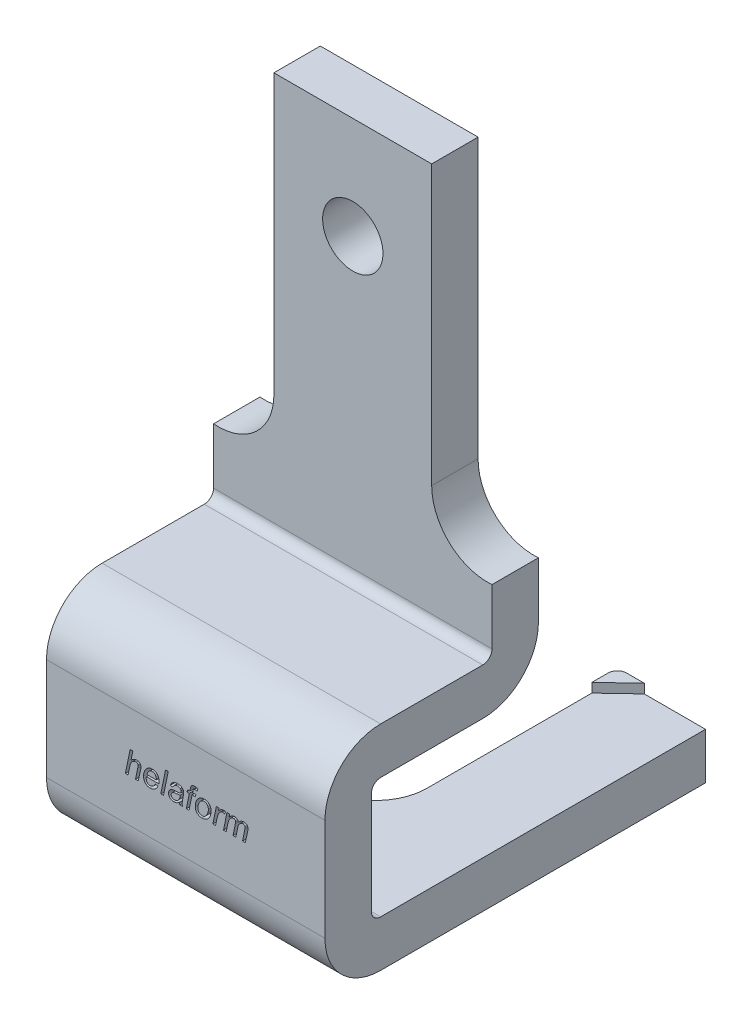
from build123d import *

# Parameters (mm, degrees)
EXTRUDE1_DEPTH     = 30
EXTRUDE4_REACH     = 78.059
FILLET2_R          = 1
EXTRUDE5_START     = 1
EXTRUDE5_DEPTH     = 1
EXTRUDE6_REACH     = 78.059
EXTRUDE7_REACH     = 78.059
SKETCH7_R          = 3.25
CUT_EXTRUDE1_DEPTH = 1


with BuildPart() as part:
    # Sketch1 → Extrude1 (new body)
    with BuildSketch(Plane(origin=(0, 0, 0), x_dir=(0, 0, -1), z_dir=(1, 0, 0))):
        with BuildLine():
            Line((0, 0), (0, -42))
            ThreePointArc((0, -42), (-0.292893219, -42.707106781), (-1, -43))
            Line((-1, -43), (-12, -43))
            ThreePointArc((-12, -43), (-16.242640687, -44.757359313), (-18, -49))
            Line((-18, -49), (-18, -60))
            ThreePointArc((-18, -60), (-16.242640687, -64.242640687), (-12, -66))
            Line((-12, -66), (23, -66))
            Line((23, -66), (23, -61))
            Line((23, -61), (-12, -61))
            ThreePointArc((-12, -61), (-12.707106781, -60.707106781), (-13, -60))
            Line((-13, -60), (-13, -49))
            ThreePointArc((-13, -49), (-12.707106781, -48.292893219), (-12, -48))
            Line((-12, -48), (-1, -48))
            ThreePointArc((-1, -48), (3.242640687, -46.242640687), (5, -42))
            Line((5, -42), (5, 0))
            Line((5, 0), (0, 0))
        make_face()
    extrude(amount=EXTRUDE1_DEPTH)

    # Sketch4 → Extrude4 (cut, up to next)
    with BuildSketch(Plane.XZ.offset(66), mode=Mode.PRIVATE) as extrude4_sk1:
        with BuildLine():
            Line((9.5, -23), (9.5, -2.5))
            ThreePointArc((9.5, -2.5), (15, 3), (20.5, -2.5))
            Line((20.5, -2.5), (20.5, -23))
            Line((20.5, -23), (9.5, -23))
        make_face()
    extrude4_tool1 = extrude(extrude4_sk1.sketch, amount=-EXTRUDE4_REACH, mode=Mode.PRIVATE) & part.part
    add(extrude4_tool1.solids().sort_by_distance((15, -66, -10.559797))[0], mode=Mode.SUBTRACT)

    # Fillet2
    fillet2_edges = [part.edges().sort_by_distance(p)[0] for p in [
        (20.5, -63.5, -23),
        (9.5, -63.5, -23),
    ]]
    fillet(fillet2_edges, radius=FILLET2_R)

    # Sketch5 → Extrude5 (add)
    with BuildSketch(Plane(origin=(0, -61, 0), x_dir=(1, 0, 0), z_dir=(0, 1, 0)).offset(EXTRUDE5_START)):
        with BuildLine():
            Line((23.404445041, 23), (20.5, 20.249691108))
            Line((20.5, 20.249691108), (20.5, 22))
            ThreePointArc((20.5, 22), (20.792893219, 22.707106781), (21.5, 23))
            Line((21.5, 23), (23.404445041, 23))
        make_face()
        with BuildLine():
            Line((6.595554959, 23), (8.5, 23))
            ThreePointArc((8.5, 23), (9.207106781, 22.707106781), (9.5, 22))
            Line((9.5, 22), (9.5, 20.249691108))
            Line((9.5, 20.249691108), (6.595554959, 23))
        make_face()
    extrude(amount=-EXTRUDE5_DEPTH)

    # Sketch6 → Extrude6 (cut, up to next)
    with BuildSketch(Plane(origin=(0, 0, -5), x_dir=(-1, 0, 0), z_dir=(0, 0, -1)), mode=Mode.PRIVATE) as extrude6_sk1:
        with BuildLine():
            Line((-6.5, 0), (-6.5, -30.020869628))
            ThreePointArc((-6.5, -30.020869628), (-4.562019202, -34.436750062), (0, -36))
            Line((0, -36), (0, 0))
            Line((0, 0), (-6.5, 0))
        make_face()
    extrude6_tool1 = extrude(extrude6_sk1.sketch, amount=-EXTRUDE6_REACH, mode=Mode.PRIVATE) & part.part
    # Sketch6 → Extrude6 (cut, up to next)
    with BuildSketch(Plane(origin=(0, 0, -5), x_dir=(-1, 0, 0), z_dir=(0, 0, -1)), mode=Mode.PRIVATE) as extrude6_sk2:
        with BuildLine():
            Line((-30, 0), (-23.5, 0))
            Line((-23.5, 0), (-23.5, -30.020869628))
            ThreePointArc((-23.5, -30.020869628), (-25.437980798, -34.436750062), (-30, -36))
            Line((-30, -36), (-30, 0))
        make_face()
    extrude6_tool2 = extrude(extrude6_sk2.sketch, amount=-EXTRUDE6_REACH, mode=Mode.PRIVATE) & part.part
    add(extrude6_tool1.solids().sort_by_distance((3.18488, -17.44132, -5))[0], mode=Mode.SUBTRACT)
    add(extrude6_tool2.solids().sort_by_distance((26.81512, -17.44132, -5))[0], mode=Mode.SUBTRACT)

    # Sketch7 → Extrude7 (cut, up to next)
    with BuildSketch(Plane(origin=(0, 0, -5), x_dir=(-1, 0, 0), z_dir=(0, 0, -1)), mode=Mode.PRIVATE) as extrude7_sk1:
        with Locations(Location((-15, -11, 0), (0, 0, 90))):
            Circle(SKETCH7_R)
    extrude7_tool1 = extrude(extrude7_sk1.sketch, amount=-EXTRUDE7_REACH, mode=Mode.PRIVATE) & part.part
    add(extrude7_tool1.solids().sort_by_distance((15, -11, -5))[0], mode=Mode.SUBTRACT)

    # Sketch8 → Cut-Extrude1 (cut)
    # profile 1 of 8: a face of its own
    with BuildSketch(Plane.XY.offset(18)):
        with BuildLine():
            Line((8.497330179, -55.373207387), (9.010150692, -52.873207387))
            Line((9.010150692, -52.873207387), (9.303620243, -52.873207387))
            Line((9.303620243, -52.873207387), (9.103800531, -53.845763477))
            add(Edge.make_bspline(
                [(9.103800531, -53.845763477), (9.131020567, -53.817891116), (9.182865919, -53.764803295), (9.262009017, -53.694031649), (9.338773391, -53.636575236), (9.413331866, -53.590693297), (9.487565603, -53.55698514), (9.561643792, -53.531541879), (9.637289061, -53.517477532), (9.688016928, -53.515311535), (9.713275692, -53.514233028)],
                knots=[0, 0, 0, 0, 1.308535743, 2.49233682, 3.562295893, 4.525943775, 5.426764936, 6.295690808, 7.151378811, 8, 8, 8, 8], degree=3))
            add(Edge.make_bspline(
                [(9.713275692, -53.514233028), (9.730983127, -53.514651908), (9.765650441, -53.515471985), (9.816117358, -53.520853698), (9.863572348, -53.530365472), (9.90793062, -53.543819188), (9.949082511, -53.561546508), (9.987529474, -53.582347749), (10.022208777, -53.607971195), (10.054480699, -53.636268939), (10.082645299, -53.668346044), (10.107829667, -53.702614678), (10.127840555, -53.740057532), (10.146141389, -53.779141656), (10.158563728, -53.821452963), (10.168384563, -53.865748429), (10.173775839, -53.912572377), (10.174595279, -53.94457597), (10.175014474, -53.960947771)],
                knots=[0, 0, 0, 0, 1.169014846, 2.288677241, 3.345563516, 4.35999745, 5.342562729, 6.299516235, 7.238597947, 8.183095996, 9.127594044, 10.051288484, 10.983620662, 11.925801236, 12.894862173, 13.887022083, 14.91908212, 16, 16, 16, 16], degree=3))
            add(Edge.make_bspline(
                [(10.175014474, -53.960947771), (10.174746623, -53.969631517), (10.174153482, -53.988861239), (10.171604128, -54.020122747), (10.166980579, -54.056361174), (10.160247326, -54.097375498), (10.152405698, -54.143516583), (10.142117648, -54.194520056), (10.130798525, -54.250689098), (10.122010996, -54.289657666), (10.117422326, -54.310006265)],
                knots=[0, 0, 0, 0, 0.588475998, 1.303150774, 2.123698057, 3.062574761, 4.118571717, 5.294001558, 6.586982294, 8, 8, 8, 8], degree=3))
            Line((10.117422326, -54.310006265), (9.88054332, -55.373207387))
            Line((9.88054332, -55.373207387), (9.587073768, -55.373207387))
            Line((9.587073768, -55.373207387), (9.824453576, -54.251412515))
            add(Edge.make_bspline(
                [(9.824453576, -54.251412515), (9.828463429, -54.232049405), (9.836098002, -54.195182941), (9.846912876, -54.142683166), (9.854966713, -54.095627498), (9.862981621, -54.054537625), (9.868266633, -54.018910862), (9.872598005, -53.989074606), (9.874520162, -53.964807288), (9.875227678, -53.950599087), (9.875535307, -53.944421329)],
                knots=[0, 0, 0, 0, 1.523510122, 2.900692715, 4.129268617, 5.201396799, 6.125444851, 6.903953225, 7.523436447, 8, 8, 8, 8], degree=3))
            add(Edge.make_bspline(
                [(9.875535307, -53.944421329), (9.87498053, -53.92998228), (9.873896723, -53.901774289), (9.86201824, -53.861851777), (9.842864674, -53.826129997), (9.816810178, -53.79482857), (9.783118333, -53.769392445), (9.742397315, -53.751286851), (9.695164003, -53.740178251), (9.661425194, -53.739139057), (9.643664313, -53.738592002)],
                knots=[0, 0, 0, 0, 0.987245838, 1.928674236, 2.824499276, 3.750363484, 4.697752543, 5.691079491, 6.784531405, 8, 8, 8, 8], degree=3))
            add(Edge.make_bspline(
                [(9.643664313, -53.738592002), (9.616698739, -53.739805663), (9.563065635, -53.742219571), (9.483548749, -53.76004258), (9.406212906, -53.789256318), (9.331878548, -53.829908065), (9.262617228, -53.880146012), (9.200161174, -53.939473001), (9.1458143, -54.007464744), (9.107651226, -54.07154095), (9.080605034, -54.128866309), (9.060038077, -54.178216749), (9.040902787, -54.234123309), (9.021238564, -54.29565309), (9.002267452, -54.363485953), (8.983889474, -54.437499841), (8.965831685, -54.517644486), (8.954771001, -54.57323478), (8.949052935, -54.601973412)],
                knots=[0, 0, 0, 0, 1.06375668, 2.115755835, 3.200026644, 4.317463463, 5.44956746, 6.568091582, 7.707210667, 8.87448921, 9.502236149, 10.208264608, 10.983462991, 11.833661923, 12.757731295, 13.762901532, 14.843482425, 16, 16, 16, 16], degree=3))
            Line((8.949052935, -54.601973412), (8.79079973, -55.373207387))
            Line((8.79079973, -55.373207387), (8.497330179, -55.373207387))
        make_face()
    # profile 2 of 8: a face of its own
    with BuildSketch(Plane.XY.offset(18)):
        with BuildLine():
            Line((11.711472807, -54.764233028), (12.008948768, -54.79628431))
            add(Edge.make_bspline(
                [(12.008948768, -54.79628431), (12.00313178, -54.814447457), (11.991385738, -54.851123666), (11.966806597, -54.904460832), (11.937026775, -54.956900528), (11.902927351, -55.009358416), (11.863288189, -55.060962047), (11.817873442, -55.111445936), (11.767835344, -55.161561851), (11.713139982, -55.210224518), (11.654998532, -55.256329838), (11.592434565, -55.295981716), (11.527315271, -55.329446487), (11.4595738, -55.357465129), (11.388908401, -55.378779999), (11.315413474, -55.394496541), (11.239111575, -55.403543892), (11.187324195, -55.40468212), (11.161092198, -55.405258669)],
                knots=[0, 0, 0, 0, 0.821440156, 1.658705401, 2.525323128, 3.419405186, 4.353419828, 5.32681938, 6.344399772, 7.404443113, 8.481060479, 9.538977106, 10.591299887, 11.633537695, 12.694215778, 13.768160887, 14.869500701, 16, 16, 16, 16], degree=3))
            add(Edge.make_bspline(
                [(11.161092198, -55.405258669), (11.128471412, -55.404035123), (11.06395101, -55.40161508), (10.969212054, -55.38441082), (10.878732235, -55.354974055), (10.793245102, -55.314543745), (10.714063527, -55.263535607), (10.645519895, -55.199550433), (10.585499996, -55.126590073), (10.537266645, -55.04270544), (10.49919886, -54.950908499), (10.47252056, -54.852066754), (10.45538819, -54.747299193), (10.453449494, -54.675326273), (10.452458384, -54.638531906)],
                knots=[0, 0, 0, 0, 0.998551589, 1.975027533, 2.936744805, 3.903838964, 4.863557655, 5.807675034, 6.763178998, 7.745855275, 8.758641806, 9.797744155, 10.874151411, 12, 12, 12, 12], degree=3))
            add(Edge.make_bspline(
                [(10.452458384, -54.638531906), (10.452800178, -54.613976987), (10.453484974, -54.564780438), (10.460387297, -54.491401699), (10.47067477, -54.418440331), (10.485969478, -54.346284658), (10.504848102, -54.274463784), (10.528517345, -54.203480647), (10.556202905, -54.132906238), (10.587982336, -54.063536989), (10.622967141, -53.996480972), (10.661444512, -53.933762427), (10.701248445, -53.874765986), (10.744292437, -53.820694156), (10.790218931, -53.771368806), (10.838217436, -53.726335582), (10.888489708, -53.685262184), (10.941754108, -53.649433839), (10.99651243, -53.617583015), (11.052427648, -53.589650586), (11.109788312, -53.56664513), (11.168228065, -53.547766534), (11.227532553, -53.532418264), (11.288016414, -53.522124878), (11.34956689, -53.515230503), (11.391107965, -53.514566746), (11.41199364, -53.514233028)],
                knots=[0, 0, 0, 0, 1.075906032, 2.155611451, 3.227554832, 4.30373447, 5.38628686, 6.480642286, 7.581143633, 8.707391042, 9.82337293, 10.893692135, 11.930684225, 12.940768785, 13.919223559, 14.881988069, 15.823529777, 16.761054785, 17.692163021, 18.598508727, 19.497917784, 20.397951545, 21.288749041, 22.180057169, 23.084984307, 24, 24, 24, 24], degree=3))
            add(Edge.make_bspline(
                [(11.41199364, -53.514233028), (11.43823365, -53.514735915), (11.489394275, -53.515716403), (11.564175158, -53.525531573), (11.634805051, -53.541358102), (11.701482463, -53.56371173), (11.764548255, -53.591375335), (11.822810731, -53.627000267), (11.877228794, -53.668226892), (11.927302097, -53.71534668), (11.972582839, -53.767880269), (12.011385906, -53.825876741), (12.045598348, -53.887713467), (12.072363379, -53.954795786), (12.093468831, -54.026221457), (12.10836041, -54.102336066), (12.117485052, -54.18291321), (12.118570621, -54.238200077), (12.119125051, -54.266436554)],
                knots=[0, 0, 0, 0, 1.079196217, 2.10412856, 3.097265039, 4.052997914, 4.993829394, 5.924450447, 6.855882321, 7.798592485, 8.748507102, 9.702980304, 10.665060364, 11.651045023, 12.668191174, 13.725659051, 14.838433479, 16, 16, 16, 16], degree=3))
            add(Edge.make_bspline(
                [(12.119125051, -54.266436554), (12.118013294, -54.311417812), (12.115748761, -54.403039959), (12.102388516, -54.493715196), (12.09558739, -54.539874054)],
                knots=[0, 0, 0, 0, 0.981886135, 2, 2, 2, 2], degree=3))
            Line((12.09558739, -54.539874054), (10.772971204, -54.539874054))
            add(Edge.make_bspline(
                [(10.772971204, -54.539874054), (10.768115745, -54.548800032), (10.758961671, -54.565628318), (10.748564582, -54.591217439), (10.742284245, -54.615523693), (10.741357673, -54.631489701), (10.740919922, -54.639032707)],
                knots=[0, 0, 0, 0, 1.156942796, 2.181202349, 3.140724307, 4, 4, 4, 4], degree=3))
            add(Edge.make_bspline(
                [(10.740919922, -54.639032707), (10.741316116, -54.660412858), (10.742085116, -54.701911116), (10.747674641, -54.762139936), (10.756529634, -54.818595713), (10.769248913, -54.871172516), (10.786696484, -54.919537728), (10.806544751, -54.964552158), (10.830388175, -55.005817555), (10.858814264, -55.042228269), (10.889151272, -55.074976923), (10.92195361, -55.102825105), (10.955580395, -55.127425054), (10.991428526, -55.147114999), (11.029075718, -55.161911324), (11.068065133, -55.173264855), (11.108781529, -55.179872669), (11.136529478, -55.180554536), (11.150575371, -55.180899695)],
                knots=[0, 0, 0, 0, 1.346284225, 2.613098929, 3.805631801, 4.942804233, 6.013450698, 7.039235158, 8.038108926, 9.00533571, 9.942442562, 10.84439418, 11.710848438, 12.56244313, 13.41163356, 14.253504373, 15.115931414, 16, 16, 16, 16], degree=3))
            add(Edge.make_bspline(
                [(11.150575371, -55.180899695), (11.177594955, -55.179738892), (11.232081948, -55.177398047), (11.312545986, -55.155039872), (11.392770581, -55.122043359), (11.456814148, -55.082713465), (11.507261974, -55.046313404), (11.542542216, -55.014352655), (11.576597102, -54.980285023), (11.607777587, -54.942577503), (11.637659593, -54.9025707), (11.664538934, -54.859150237), (11.689871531, -54.813187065), (11.704202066, -54.780710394), (11.711472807, -54.764233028)],
                knots=[0, 0, 0, 0, 1.313044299, 2.647851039, 4.03980324, 5.527339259, 6.29475363, 7.066375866, 7.842396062, 8.63863277, 9.446691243, 10.272184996, 11.123375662, 12, 12, 12, 12], degree=3))
        make_face()
        with BuildLine():
            Line((10.82204973, -54.315515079), (11.829161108, -54.315515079))
            add(Edge.make_bspline(
                [(11.829161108, -54.315515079), (11.829520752, -54.301159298), (11.830122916, -54.277122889), (11.830508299, -54.25308209), (11.830663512, -54.243399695)],
                knots=[0, 0, 0, 0, 1.194503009, 2, 2, 2, 2], degree=3))
            add(Edge.make_bspline(
                [(11.830663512, -54.243399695), (11.830195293, -54.223694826), (11.829281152, -54.185223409), (11.824622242, -54.129248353), (11.815415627, -54.076891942), (11.803224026, -54.027960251), (11.786353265, -53.98292403), (11.767245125, -53.9408864), (11.743175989, -53.903065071), (11.716357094, -53.868653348), (11.686678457, -53.837884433), (11.654734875, -53.811369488), (11.620548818, -53.789047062), (11.584635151, -53.770280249), (11.546091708, -53.756518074), (11.505979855, -53.745681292), (11.463587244, -53.73973329), (11.43471359, -53.738977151), (11.420006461, -53.738592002)],
                knots=[0, 0, 0, 0, 1.288915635, 2.516454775, 3.668675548, 4.762204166, 5.808675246, 6.809806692, 7.776046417, 8.732555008, 9.659000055, 10.566141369, 11.441184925, 12.324901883, 13.209090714, 14.112018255, 15.038334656, 16, 16, 16, 16], degree=3))
            add(Edge.make_bspline(
                [(11.420006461, -53.738592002), (11.403780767, -53.73886395), (11.371671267, -53.739402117), (11.32417205, -53.747170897), (11.277497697, -53.757613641), (11.232297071, -53.774188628), (11.187970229, -53.794192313), (11.144635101, -53.818669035), (11.103203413, -53.848851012), (11.062011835, -53.882017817), (11.022727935, -53.920222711), (10.986503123, -53.963492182), (10.951907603, -54.010656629), (10.921443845, -54.063152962), (10.891782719, -54.119247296), (10.866341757, -54.180732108), (10.841818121, -54.246155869), (10.828740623, -54.292039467), (10.82204973, -54.315515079)],
                knots=[0, 0, 0, 0, 0.867869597, 1.717452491, 2.571772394, 3.425671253, 4.289803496, 5.174634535, 6.084973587, 7.031591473, 8.005136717, 9.013559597, 10.050697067, 11.133079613, 12.260592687, 13.446148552, 14.693362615, 16, 16, 16, 16], degree=3))
        make_face(mode=Mode.SUBTRACT)
    # profile 3 of 8: a face of its own
    with BuildSketch(Plane.XY.offset(18)):
        Polygon((12.313435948, -55.373207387), (12.824253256, -52.873207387), (13.117722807, -52.873207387), (12.606905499, -55.373207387), align=None)
    # profile 4 of 8: a face of its own
    with BuildSketch(Plane.XY.offset(18)):
        with BuildLine():
            add(Edge.make_bspline(
                [(14.330663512, -55.149850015), (14.304413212, -55.171427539), (14.253687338, -55.213123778), (14.175451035, -55.267417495), (14.098580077, -55.311888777), (14.022517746, -55.347065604), (13.946040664, -55.373637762), (13.867372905, -55.391301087), (13.786511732, -55.403580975), (13.731417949, -55.404696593), (13.703660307, -55.405258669)],
                knots=[0, 0, 0, 0, 1.176742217, 2.273927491, 3.294581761, 4.249353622, 5.172863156, 6.093035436, 7.039223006, 8, 8, 8, 8], degree=3))
            add(Edge.make_bspline(
                [(13.703660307, -55.405258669), (13.6832812, -55.40469579), (13.643254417, -55.403590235), (13.584695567, -55.397347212), (13.529254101, -55.38566584), (13.476896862, -55.369694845), (13.427584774, -55.349052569), (13.381058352, -55.324019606), (13.338106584, -55.293646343), (13.297867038, -55.259792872), (13.262048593, -55.221887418), (13.230832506, -55.181000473), (13.204009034, -55.137861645), (13.182514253, -55.091873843), (13.165284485, -55.04363919), (13.153274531, -54.99258715), (13.146299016, -54.939040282), (13.14528201, -54.902474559), (13.144766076, -54.883924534)],
                knots=[0, 0, 0, 0, 1.139245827, 2.237602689, 3.286124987, 4.301365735, 5.2925262, 6.269488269, 7.247875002, 8.227506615, 9.204290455, 10.15602149, 11.098561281, 12.037631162, 12.987851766, 13.95644656, 14.963292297, 16, 16, 16, 16], degree=3))
            add(Edge.make_bspline(
                [(13.144766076, -54.883924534), (13.145395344, -54.859481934), (13.146628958, -54.811564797), (13.160400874, -54.74236984), (13.180570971, -54.67703248), (13.210548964, -54.617029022), (13.247221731, -54.561969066), (13.289354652, -54.511964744), (13.337494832, -54.468111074), (13.391040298, -54.429666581), (13.450713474, -54.397079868), (13.516299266, -54.369780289), (13.587650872, -54.346186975), (13.638089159, -54.335862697), (13.664097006, -54.330539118)],
                knots=[0, 0, 0, 0, 1.057058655, 2.072251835, 3.043911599, 4.010610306, 4.965012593, 5.903623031, 6.834882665, 7.777798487, 8.75171468, 9.772170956, 10.851248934, 12, 12, 12, 12], degree=3))
            add(Edge.make_bspline(
                [(13.664097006, -54.330539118), (13.673933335, -54.32878652), (13.695207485, -54.324995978), (13.730169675, -54.320722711), (13.770571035, -54.316243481), (13.816629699, -54.311666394), (13.868226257, -54.307710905), (13.92534273, -54.30440611), (13.987925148, -54.300684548), (14.054398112, -54.298057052), (14.121223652, -54.294960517), (14.184828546, -54.289839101), (14.243438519, -54.283859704), (14.296960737, -54.277167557), (14.345361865, -54.268474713), (14.388670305, -54.259147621), (14.427296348, -54.24889656), (14.450747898, -54.240073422), (14.461873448, -54.235887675)],
                knots=[0, 0, 0, 0, 0.595113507, 1.287119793, 2.097608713, 3.016901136, 4.044304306, 5.180150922, 6.425203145, 7.779016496, 9.143236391, 10.410139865, 11.579789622, 12.652956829, 13.622514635, 14.508107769, 15.292237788, 16, 16, 16, 16], degree=3))
            add(Edge.make_bspline(
                [(14.461873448, -54.235887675), (14.466148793, -54.214374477), (14.474312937, -54.173293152), (14.484379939, -54.114285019), (14.489282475, -54.060690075), (14.490396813, -54.026893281), (14.490919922, -54.0110279)],
                knots=[0, 0, 0, 0, 1.159062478, 2.213330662, 3.161275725, 4, 4, 4, 4], degree=3))
            add(Edge.make_bspline(
                [(14.490919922, -54.0110279), (14.490261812, -53.9927007), (14.489000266, -53.95756889), (14.473579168, -53.908421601), (14.450146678, -53.864441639), (14.426665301, -53.841721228), (14.414798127, -53.830238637)],
                knots=[0, 0, 0, 0, 1.082179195, 2.074452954, 3.026854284, 4, 4, 4, 4], degree=3))
            add(Edge.make_bspline(
                [(14.414798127, -53.830238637), (14.405791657, -53.822816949), (14.387581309, -53.807810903), (14.356388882, -53.789392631), (14.322637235, -53.773294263), (14.285527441, -53.760942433), (14.245846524, -53.750988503), (14.203221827, -53.743263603), (14.157451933, -53.739576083), (14.126007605, -53.738926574), (14.109810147, -53.738592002)],
                knots=[0, 0, 0, 0, 0.859677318, 1.738197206, 2.663619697, 3.613780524, 4.617262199, 5.680109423, 6.804988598, 8, 8, 8, 8], degree=3))
            add(Edge.make_bspline(
                [(14.109810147, -53.738592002), (14.07965791, -53.739449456), (14.021630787, -53.7410996), (13.93907789, -53.75928186), (13.864400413, -53.787452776), (13.799220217, -53.828918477), (13.742359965, -53.88009537), (13.694295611, -53.94137995), (13.654252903, -54.012163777), (13.635303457, -54.064287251), (13.625535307, -54.091156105)],
                knots=[0, 0, 0, 0, 1.116846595, 2.149339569, 3.120005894, 4.063359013, 4.997375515, 5.94525119, 6.940808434, 8, 8, 8, 8], degree=3))
            Line((13.625535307, -54.091156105), (13.337073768, -54.059104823))
            add(Edge.make_bspline(
                [(13.337073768, -54.059104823), (13.344978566, -54.037627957), (13.360496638, -53.995466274), (13.388183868, -53.934903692), (13.419599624, -53.878531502), (13.454465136, -53.826109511), (13.492112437, -53.777257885), (13.532996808, -53.732022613), (13.578075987, -53.691322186), (13.626100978, -53.654271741), (13.677335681, -53.620923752), (13.732073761, -53.592422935), (13.790119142, -53.568387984), (13.851110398, -53.548146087), (13.91558309, -53.533434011), (13.982983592, -53.522465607), (14.053722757, -53.515045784), (14.102111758, -53.514507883), (14.12683739, -53.514233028)],
                knots=[0, 0, 0, 0, 1.062635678, 2.086082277, 3.089150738, 4.056806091, 5.007446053, 5.951423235, 6.884447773, 7.824212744, 8.766149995, 9.719820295, 10.6859836, 11.681412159, 12.700709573, 13.753541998, 14.852113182, 16, 16, 16, 16], degree=3))
            add(Edge.make_bspline(
                [(14.12683739, -53.514233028), (14.152898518, -53.514687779), (14.203798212, -53.515575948), (14.278117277, -53.523254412), (14.348334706, -53.535529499), (14.414326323, -53.553183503), (14.476298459, -53.575396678), (14.533476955, -53.603949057), (14.587257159, -53.636196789), (14.619560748, -53.662091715), (14.635651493, -53.674990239)],
                knots=[0, 0, 0, 0, 1.147245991, 2.240673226, 3.286002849, 4.282675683, 5.245377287, 6.178960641, 7.092921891, 8, 8, 8, 8], degree=3))
            add(Edge.make_bspline(
                [(14.635651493, -53.674990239), (14.647057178, -53.685112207), (14.669617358, -53.705133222), (14.699120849, -53.738673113), (14.723906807, -53.774535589), (14.744038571, -53.812579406), (14.760462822, -53.852708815), (14.770963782, -53.895606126), (14.778578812, -53.940311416), (14.779111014, -53.970929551), (14.779381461, -53.986488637)],
                knots=[0, 0, 0, 0, 1.030059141, 2.037432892, 3.010866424, 3.970002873, 4.942258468, 5.933000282, 6.949621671, 8, 8, 8, 8], degree=3))
            add(Edge.make_bspline(
                [(14.779381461, -53.986488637), (14.779046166, -54.011712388), (14.778347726, -54.064255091), (14.77052031, -54.145745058), (14.759811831, -54.233172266), (14.749280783, -54.293020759), (14.74382457, -54.324028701)],
                knots=[0, 0, 0, 0, 0.890374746, 1.854708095, 2.888508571, 4, 4, 4, 4], degree=3))
            Line((14.74382457, -54.324028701), (14.659189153, -54.775751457))
            add(Edge.make_bspline(
                [(14.659189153, -54.775751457), (14.653080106, -54.809931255), (14.641458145, -54.874955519), (14.629072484, -54.967850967), (14.620843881, -55.05071112), (14.61967211, -55.102591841), (14.619125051, -55.126813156)],
                knots=[0, 0, 0, 0, 1.17760315, 2.240293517, 3.178453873, 4, 4, 4, 4], degree=3))
            add(Edge.make_bspline(
                [(14.619125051, -55.126813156), (14.619571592, -55.142687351), (14.620551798, -55.177532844), (14.627418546, -55.234439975), (14.636488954, -55.30086379), (14.645740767, -55.348042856), (14.650675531, -55.373207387)],
                knots=[0, 0, 0, 0, 0.765813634, 1.681039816, 2.763105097, 4, 4, 4, 4], degree=3))
            Line((14.650675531, -55.373207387), (14.359709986, -55.373207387))
            add(Edge.make_bspline(
                [(14.359709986, -55.373207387), (14.356372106, -55.357546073), (14.349303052, -55.324378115), (14.341667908, -55.271338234), (14.335064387, -55.212552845), (14.332175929, -55.171398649), (14.330663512, -55.149850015)],
                knots=[0, 0, 0, 0, 0.852057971, 1.804511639, 2.850426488, 4, 4, 4, 4], degree=3))
        make_face()
        with BuildLine():
            add(Edge.make_bspline(
                [(14.423812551, -54.431700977), (14.403602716, -54.43982921), (14.362414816, -54.456394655), (14.305619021, -54.470835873), (14.250528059, -54.479897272), (14.193493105, -54.486419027), (14.12107536, -54.494146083), (14.067589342, -54.498447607), (14.038195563, -54.500811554)],
                knots=[0, 0, 0, 0, 0.995082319, 2.02799051, 2.670388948, 3.546965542, 4.651910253, 6, 6, 6, 6], degree=3))
            add(Edge.make_bspline(
                [(14.038195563, -54.500811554), (14.016983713, -54.50288275), (13.97619314, -54.50686568), (13.917488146, -54.51420002), (13.86343545, -54.520672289), (13.814134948, -54.529152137), (13.769284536, -54.536769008), (13.729041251, -54.545353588), (13.693556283, -54.554159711), (13.653382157, -54.566623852), (13.609004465, -54.584607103), (13.562291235, -54.612517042), (13.521858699, -54.645554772), (13.489886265, -54.685203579), (13.464884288, -54.728275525), (13.446699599, -54.77381324), (13.435012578, -54.821573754), (13.433828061, -54.854309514), (13.433227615, -54.870903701)],
                knots=[0, 0, 0, 0, 1.291140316, 2.482874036, 3.58428306, 4.588539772, 5.513036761, 6.340191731, 7.080974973, 7.727139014, 8.887871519, 9.971916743, 11.013029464, 12.033452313, 13.039540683, 14.019883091, 14.996252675, 16, 16, 16, 16], degree=3))
            add(Edge.make_bspline(
                [(13.433227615, -54.870903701), (13.434130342, -54.892571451), (13.435891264, -54.934838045), (13.45418331, -54.994858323), (13.483274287, -55.048877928), (13.523825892, -55.095768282), (13.57502096, -55.134628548), (13.637232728, -55.161378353), (13.708449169, -55.178240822), (13.759144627, -55.179983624), (13.785791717, -55.180899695)],
                knots=[0, 0, 0, 0, 0.980060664, 1.911773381, 2.816178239, 3.744810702, 4.701647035, 5.704679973, 6.793509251, 8, 8, 8, 8], degree=3))
            add(Edge.make_bspline(
                [(13.785791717, -55.180899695), (13.811733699, -55.179739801), (13.863737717, -55.177414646), (13.940921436, -55.161615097), (14.016018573, -55.134360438), (14.088974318, -55.098320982), (14.156567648, -55.051988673), (14.217099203, -54.997233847), (14.267454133, -54.933038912), (14.302216, -54.873424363), (14.326101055, -54.820854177), (14.342682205, -54.776830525), (14.35958315, -54.729283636), (14.374302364, -54.677501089), (14.388434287, -54.62174246), (14.401219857, -54.561899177), (14.413362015, -54.498130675), (14.420263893, -54.454258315), (14.423812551, -54.431700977)],
                knots=[0, 0, 0, 0, 1.142235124, 2.289756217, 3.452247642, 4.652135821, 5.863229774, 7.049462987, 8.231909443, 9.44094933, 10.079113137, 10.772583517, 11.511838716, 12.300429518, 13.141924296, 14.044484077, 14.994555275, 16, 16, 16, 16], degree=3))
        make_face(mode=Mode.SUBTRACT)
    # profile 5 of 8: a face of its own
    with BuildSketch(Plane.XY.offset(18)):
        with BuildLine():
            Line((15.067842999, -55.373207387), (15.390359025, -53.770643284))
            Line((15.390359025, -53.770643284), (15.131945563, -53.770643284))
            Line((15.131945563, -53.770643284), (15.196048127, -53.54628431))
            Line((15.196048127, -53.54628431), (15.446448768, -53.54628431))
            Line((15.446448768, -53.54628431), (15.496028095, -53.297886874))
            add(Edge.make_bspline(
                [(15.496028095, -53.297886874), (15.502141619, -53.26912351), (15.513533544, -53.215525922), (15.532634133, -53.142005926), (15.552713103, -53.081510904), (15.572749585, -53.031637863), (15.597141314, -52.989787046), (15.628425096, -52.95417163), (15.665432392, -52.921800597), (15.709003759, -52.892787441), (15.760775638, -52.868848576), (15.82193133, -52.852907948), (15.892001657, -52.842948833), (15.941869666, -52.841776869), (15.968283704, -52.841156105)],
                knots=[0, 0, 0, 0, 1.429250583, 2.663262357, 3.689602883, 4.525968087, 5.271832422, 6.031341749, 6.819062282, 7.656214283, 8.567470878, 9.577289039, 10.716740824, 12, 12, 12, 12], degree=3))
            add(Edge.make_bspline(
                [(15.968283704, -52.841156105), (15.978634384, -52.841449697), (16.000351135, -52.842065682), (16.03447111, -52.84387), (16.07167006, -52.848236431), (16.112306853, -52.853521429), (16.156103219, -52.861421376), (16.203467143, -52.869636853), (16.253826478, -52.880332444), (16.288472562, -52.8881894), (16.30632457, -52.892237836)],
                knots=[0, 0, 0, 0, 0.72558998, 1.522359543, 2.392979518, 3.349131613, 4.393312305, 5.510664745, 6.717326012, 8, 8, 8, 8], degree=3))
            Line((16.30632457, -52.892237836), (16.250735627, -53.159164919))
            add(Edge.make_bspline(
                [(16.250735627, -53.159164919), (16.225899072, -53.154593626), (16.178535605, -53.145876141), (16.110159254, -53.137004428), (16.048181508, -53.13105905), (16.008860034, -53.130079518), (15.990318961, -53.129617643)],
                knots=[0, 0, 0, 0, 1.154599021, 2.201827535, 3.152116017, 4, 4, 4, 4], degree=3))
            add(Edge.make_bspline(
                [(15.990318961, -53.129617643), (15.976237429, -53.129923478), (15.949613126, -53.130501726), (15.912425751, -53.139443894), (15.880042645, -53.15263725), (15.851697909, -53.173373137), (15.828800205, -53.206242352), (15.808236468, -53.2516593), (15.789994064, -53.312303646), (15.779662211, -53.35790949), (15.773972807, -53.383023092)],
                knots=[0, 0, 0, 0, 0.903865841, 1.708961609, 2.445191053, 3.14337528, 3.933937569, 4.991014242, 6.34305285, 8, 8, 8, 8], degree=3))
            Line((15.773972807, -53.383023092), (15.740419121, -53.54628431))
            Line((15.740419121, -53.54628431), (16.093484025, -53.54628431))
            Line((16.093484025, -53.54628431), (16.029381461, -53.770643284))
            Line((16.029381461, -53.770643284), (15.684329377, -53.770643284))
            Line((15.684329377, -53.770643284), (15.361312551, -55.373207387))
            Line((15.361312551, -55.373207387), (15.067842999, -55.373207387))
        make_face()
    # profile 6 of 8: a face of its own
    with BuildSketch(Plane.XY.offset(18)):
        with BuildLine():
            add(Edge.make_bspline(
                [(16.029381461, -54.677594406), (16.030336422, -54.634316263), (16.032207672, -54.549512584), (16.04709709, -54.425214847), (16.071012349, -54.306576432), (16.104372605, -54.193402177), (16.148301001, -54.086171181), (16.201552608, -53.984709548), (16.264151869, -53.888489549), (16.313529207, -53.830082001), (16.338375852, -53.800691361)],
                knots=[0, 0, 0, 0, 1.091636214, 2.139065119, 3.15337043, 4.142118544, 5.111151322, 6.071929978, 7.029796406, 8, 8, 8, 8], degree=3))
            add(Edge.make_bspline(
                [(16.338375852, -53.800691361), (16.35990742, -53.77779116), (16.402428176, -53.732567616), (16.474484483, -53.674507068), (16.550635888, -53.62426663), (16.632645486, -53.584311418), (16.719080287, -53.552239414), (16.810806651, -53.530780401), (16.907177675, -53.516590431), (16.973171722, -53.515031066), (17.006945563, -53.514233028)],
                knots=[0, 0, 0, 0, 1.003816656, 1.982347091, 2.950416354, 3.914638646, 4.892193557, 5.891460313, 6.920910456, 8, 8, 8, 8], degree=3))
            add(Edge.make_bspline(
                [(17.006945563, -53.514233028), (17.03335267, -53.514739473), (17.08501193, -53.515730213), (17.16061055, -53.525568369), (17.232335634, -53.541244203), (17.299952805, -53.564219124), (17.363870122, -53.592440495), (17.423454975, -53.628079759), (17.479341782, -53.669697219), (17.530561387, -53.71784525), (17.577535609, -53.770699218), (17.617433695, -53.829229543), (17.651788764, -53.891726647), (17.680102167, -53.958772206), (17.701316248, -54.030586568), (17.716794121, -54.106649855), (17.726617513, -54.187053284), (17.727597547, -54.242202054), (17.728099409, -54.270442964)],
                knots=[0, 0, 0, 0, 1.074521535, 2.102047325, 3.097891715, 4.058516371, 5.004534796, 5.936932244, 6.87884093, 7.835708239, 8.794022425, 9.751637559, 10.712718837, 11.693422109, 12.708216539, 13.755795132, 14.850774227, 16, 16, 16, 16], degree=3))
            add(Edge.make_bspline(
                [(17.728099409, -54.270442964), (17.727728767, -54.296163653), (17.726991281, -54.347341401), (17.720634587, -54.423369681), (17.711321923, -54.498124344), (17.697861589, -54.571596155), (17.679634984, -54.643538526), (17.658076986, -54.714232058), (17.6332267, -54.783672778), (17.603595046, -54.850921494), (17.570828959, -54.915717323), (17.53484463, -54.977166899), (17.494937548, -55.034264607), (17.452693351, -55.088143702), (17.406141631, -55.137422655), (17.356454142, -55.182911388), (17.304020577, -55.225381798), (17.247791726, -55.2625264), (17.190063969, -55.295925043), (17.131250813, -55.325197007), (17.071653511, -55.349758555), (17.011187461, -55.369748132), (16.950096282, -55.386208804), (16.88785436, -55.396708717), (16.825179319, -55.404396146), (16.783111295, -55.404970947), (16.762053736, -55.405258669)],
                knots=[0, 0, 0, 0, 1.113712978, 2.216010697, 3.301923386, 4.375322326, 5.448404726, 6.514107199, 7.57523888, 8.640352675, 9.694367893, 10.718505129, 11.721213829, 12.709140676, 13.680905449, 14.653046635, 15.625160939, 16.599638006, 17.568089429, 18.512164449, 19.442549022, 20.357011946, 21.268841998, 22.179295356, 23.088628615, 24, 24, 24, 24], degree=3))
            add(Edge.make_bspline(
                [(16.762053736, -55.405258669), (16.727923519, -55.404283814), (16.660724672, -55.402364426), (16.562538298, -55.38469073), (16.468926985, -55.356680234), (16.380940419, -55.317261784), (16.300343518, -55.26734274), (16.228666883, -55.207929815), (16.167981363, -55.138132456), (16.117393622, -55.059910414), (16.077488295, -54.9735975), (16.049951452, -54.880433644), (16.032119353, -54.78110516), (16.030310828, -54.712730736), (16.029381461, -54.677594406)],
                knots=[0, 0, 0, 0, 1.056399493, 2.079940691, 3.079426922, 4.07698514, 5.057020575, 6.007752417, 6.949498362, 7.910468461, 8.884496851, 9.883983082, 10.912618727, 12, 12, 12, 12], degree=3))
        make_face()
        with BuildLine():
            add(Edge.make_bspline(
                [(16.317842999, -54.651051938), (16.31818512, -54.672103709), (16.31884913, -54.712962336), (16.325192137, -54.77232785), (16.334254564, -54.827856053), (16.347932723, -54.879473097), (16.365328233, -54.927190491), (16.38688574, -54.971095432), (16.412597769, -55.010786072), (16.441686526, -55.046722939), (16.474373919, -55.077774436), (16.508413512, -55.105952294), (16.545426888, -55.129002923), (16.584338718, -55.148043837), (16.625517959, -55.162742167), (16.668667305, -55.173087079), (16.713925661, -55.179942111), (16.744833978, -55.180576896), (16.760551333, -55.180899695)],
                knots=[0, 0, 0, 0, 1.295111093, 2.513634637, 3.670576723, 4.754563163, 5.794674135, 6.791678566, 7.757713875, 8.699574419, 9.629537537, 10.528041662, 11.414483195, 12.305852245, 13.189730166, 14.099209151, 15.033418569, 16, 16, 16, 16], degree=3))
            add(Edge.make_bspline(
                [(16.760551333, -55.180899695), (16.777268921, -55.180400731), (16.810870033, -55.179397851), (16.861278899, -55.171722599), (16.91124437, -55.158389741), (16.961099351, -55.141096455), (17.009780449, -55.117914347), (17.056800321, -55.089233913), (17.102255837, -55.055569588), (17.144908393, -55.016238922), (17.186004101, -54.973466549), (17.223650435, -54.926989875), (17.258771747, -54.878008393), (17.300639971, -54.808166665), (17.346513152, -54.714784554), (17.372770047, -54.635545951), (17.386052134, -54.595462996)],
                knots=[0, 0, 0, 0, 0.76417638, 1.535937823, 2.324535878, 3.125956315, 3.945310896, 4.784335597, 5.640677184, 6.526804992, 7.433724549, 8.350386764, 9.258910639, 10.186940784, 12.071158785, 14, 14, 14, 14], degree=3))
            add(Edge.make_bspline(
                [(17.386052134, -54.595462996), (17.394366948, -54.567200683), (17.410706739, -54.511661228), (17.426781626, -54.427819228), (17.437468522, -54.345838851), (17.438920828, -54.291675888), (17.439637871, -54.26493415)],
                knots=[0, 0, 0, 0, 1.051458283, 2.066264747, 3.045261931, 4, 4, 4, 4], degree=3))
            add(Edge.make_bspline(
                [(17.439637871, -54.26493415), (17.439286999, -54.244716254), (17.438601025, -54.205189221), (17.43229851, -54.14783019), (17.423300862, -54.093712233), (17.408763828, -54.043490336), (17.391873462, -53.996102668), (17.36917003, -53.952895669), (17.344042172, -53.912481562), (17.314060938, -53.876490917), (17.281796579, -53.844031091), (17.247107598, -53.815706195), (17.210274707, -53.792288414), (17.171838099, -53.77206769), (17.130732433, -53.757519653), (17.087905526, -53.746228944), (17.043044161, -53.739596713), (17.012475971, -53.738930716), (16.996929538, -53.738592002)],
                knots=[0, 0, 0, 0, 1.253550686, 2.450756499, 3.575994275, 4.651243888, 5.689823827, 6.690069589, 7.672416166, 8.636253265, 9.588057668, 10.508190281, 11.407164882, 12.291652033, 13.195740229, 14.104854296, 15.036162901, 16, 16, 16, 16], degree=3))
            add(Edge.make_bspline(
                [(16.996929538, -53.738592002), (16.972833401, -53.739478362), (16.92528462, -53.741227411), (16.855657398, -53.754514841), (16.789259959, -53.776721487), (16.726516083, -53.808156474), (16.666766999, -53.847604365), (16.610589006, -53.895813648), (16.556921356, -53.951635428), (16.506435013, -54.014957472), (16.461369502, -54.085439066), (16.421030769, -54.161464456), (16.389127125, -54.243921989), (16.362874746, -54.329857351), (16.343783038, -54.41595511), (16.328676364, -54.49857109), (16.319925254, -54.576409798), (16.31851877, -54.626827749), (16.317842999, -54.651051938)],
                knots=[0, 0, 0, 0, 0.919050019, 1.813556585, 2.693819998, 3.582615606, 4.483630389, 5.419133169, 6.401208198, 7.434815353, 8.503776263, 9.589310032, 10.713026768, 11.871659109, 13.015133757, 14.075998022, 15.075579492, 16, 16, 16, 16], degree=3))
        make_face(mode=Mode.SUBTRACT)
    # profile 7 of 8: a face of its own
    with BuildSketch(Plane.XY.offset(18)):
        with BuildLine():
            Line((17.920407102, -55.373207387), (18.305022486, -53.54628431))
            Line((18.305022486, -53.54628431), (18.598492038, -53.54628431))
            Line((18.598492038, -53.54628431), (18.510851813, -53.860286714))
            add(Edge.make_bspline(
                [(18.510851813, -53.860286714), (18.535234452, -53.832445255), (18.581785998, -53.779290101), (18.653534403, -53.707808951), (18.723110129, -53.647716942), (18.791114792, -53.598858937), (18.858594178, -53.560790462), (18.926583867, -53.533886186), (18.995543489, -53.517719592), (19.04178715, -53.515389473), (19.064738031, -53.514233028)],
                knots=[0, 0, 0, 0, 1.317415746, 2.515221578, 3.602797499, 4.587383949, 5.492011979, 6.354026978, 7.183098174, 8, 8, 8, 8], degree=3))
            add(Edge.make_bspline(
                [(19.064738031, -53.514233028), (19.080946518, -53.514659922), (19.115131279, -53.515560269), (19.168797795, -53.522059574), (19.227629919, -53.532087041), (19.268272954, -53.54139864), (19.289597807, -53.54628431)],
                knots=[0, 0, 0, 0, 0.854454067, 1.802099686, 2.846791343, 4, 4, 4, 4], degree=3))
            Line((19.289597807, -53.54628431), (19.164397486, -53.834745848))
            add(Edge.make_bspline(
                [(19.164397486, -53.834745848), (19.151411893, -53.820141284), (19.126848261, -53.792515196), (19.08347147, -53.761930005), (19.03798582, -53.742015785), (19.006335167, -53.739727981), (18.990619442, -53.738592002)],
                knots=[0, 0, 0, 0, 1.139610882, 2.155695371, 3.084234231, 4, 4, 4, 4], degree=3))
            add(Edge.make_bspline(
                [(18.990619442, -53.738592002), (18.977042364, -53.73914938), (18.949395, -53.740284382), (18.908148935, -53.750476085), (18.86643683, -53.766238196), (18.82443977, -53.788590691), (18.781791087, -53.816882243), (18.738516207, -53.851166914), (18.695054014, -53.892075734), (18.650600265, -53.939089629), (18.607230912, -53.994601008), (18.566060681, -54.059869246), (18.527427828, -54.135155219), (18.490415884, -54.220158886), (18.455359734, -54.314927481), (18.423434, -54.419831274), (18.39181716, -54.534200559), (18.374246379, -54.61439844), (18.36511864, -54.656059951)],
                knots=[0, 0, 0, 0, 0.549463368, 1.118886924, 1.711931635, 2.353427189, 3.042026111, 3.783708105, 4.587857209, 5.458936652, 6.403515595, 7.437581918, 8.58132111, 9.829397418, 11.192852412, 12.673529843, 14.271952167, 16, 16, 16, 16], degree=3))
            Line((18.36511864, -54.656059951), (18.214377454, -55.373207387))
            Line((18.214377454, -55.373207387), (17.920407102, -55.373207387))
        make_face()
    # profile 8 of 8: a face of its own
    with BuildSketch(Plane.XY.offset(18)):
        with BuildLine():
            Line((19.074253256, -55.373207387), (19.442342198, -53.54628431))
            Line((19.442342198, -53.54628431), (19.735811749, -53.54628431))
            Line((19.735811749, -53.54628431), (19.66970598, -53.872305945))
            add(Edge.make_bspline(
                [(19.66970598, -53.872305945), (19.683453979, -53.855853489), (19.71001278, -53.824070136), (19.750439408, -53.779303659), (19.789302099, -53.738175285), (19.827356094, -53.701042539), (19.864341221, -53.668016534), (19.900125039, -53.638821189), (19.934345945, -53.612995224), (19.979122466, -53.585313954), (20.035194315, -53.556184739), (20.106131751, -53.532258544), (20.179717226, -53.517144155), (20.229862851, -53.51520873), (20.255142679, -53.514233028)],
                knots=[0, 0, 0, 0, 1.084132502, 2.094360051, 3.049733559, 3.945196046, 4.782250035, 5.556179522, 6.280499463, 6.948038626, 8.216550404, 9.465929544, 10.722503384, 12, 12, 12, 12], degree=3))
            add(Edge.make_bspline(
                [(20.255142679, -53.514233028), (20.281437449, -53.515231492), (20.332414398, -53.517167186), (20.405617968, -53.53382986), (20.471728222, -53.562410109), (20.530912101, -53.601170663), (20.582025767, -53.650139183), (20.623363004, -53.708741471), (20.655727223, -53.775919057), (20.668312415, -53.824943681), (20.674814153, -53.850270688)],
                knots=[0, 0, 0, 0, 1.075592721, 2.085222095, 3.052587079, 4.009808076, 4.966833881, 5.932096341, 6.931683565, 8, 8, 8, 8], degree=3))
            add(Edge.make_bspline(
                [(20.674814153, -53.850270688), (20.697083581, -53.82350972), (20.740201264, -53.771695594), (20.810014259, -53.702630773), (20.881910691, -53.644665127), (20.955422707, -53.596965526), (21.031169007, -53.559751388), (21.109227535, -53.533973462), (21.189057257, -53.516790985), (21.24313569, -53.515087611), (21.270266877, -53.514233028)],
                knots=[0, 0, 0, 0, 1.178955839, 2.282673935, 3.320441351, 4.302439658, 5.245851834, 6.17043085, 7.082103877, 8, 8, 8, 8], degree=3))
            add(Edge.make_bspline(
                [(21.270266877, -53.514233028), (21.288137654, -53.514690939), (21.322781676, -53.515578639), (21.373089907, -53.520316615), (21.419834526, -53.529388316), (21.463103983, -53.541880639), (21.503143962, -53.557709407), (21.539182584, -53.578232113), (21.572818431, -53.600848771), (21.601703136, -53.628569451), (21.628117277, -53.658351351), (21.649930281, -53.691930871), (21.669315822, -53.727596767), (21.68476466, -53.766453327), (21.696833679, -53.80822221), (21.705025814, -53.853031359), (21.710944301, -53.900527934), (21.711294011, -53.933217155), (21.711472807, -53.949930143)],
                knots=[0, 0, 0, 0, 1.211510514, 2.348616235, 3.420404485, 4.433742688, 5.398144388, 6.330073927, 7.240321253, 8.136965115, 9.035320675, 9.932820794, 10.843981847, 11.783163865, 12.760750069, 13.785957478, 14.868028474, 16, 16, 16, 16], degree=3))
            add(Edge.make_bspline(
                [(21.711472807, -53.949930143), (21.710863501, -53.965973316), (21.709475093, -54.002530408), (21.701171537, -54.064031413), (21.687937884, -54.138751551), (21.676886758, -54.193010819), (21.670907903, -54.222366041)],
                knots=[0, 0, 0, 0, 0.698199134, 1.590965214, 2.696669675, 4, 4, 4, 4], degree=3))
            Line((21.670907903, -54.222366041), (21.419004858, -55.373207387))
            Line((21.419004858, -55.373207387), (21.125535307, -55.373207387))
            Line((21.125535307, -55.373207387), (21.36892473, -54.148748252))
            add(Edge.make_bspline(
                [(21.36892473, -54.148748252), (21.373757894, -54.125573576), (21.382670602, -54.082837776), (21.392686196, -54.023719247), (21.399355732, -53.975284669), (21.400485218, -53.946438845), (21.400976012, -53.933904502)],
                knots=[0, 0, 0, 0, 1.305873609, 2.408126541, 3.308285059, 4, 4, 4, 4], degree=3))
            add(Edge.make_bspline(
                [(21.400976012, -53.933904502), (21.40031223, -53.919495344), (21.399043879, -53.891962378), (21.389166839, -53.85279505), (21.370996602, -53.819024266), (21.346720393, -53.790056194), (21.316191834, -53.766677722), (21.279811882, -53.749914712), (21.237837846, -53.740612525), (21.208213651, -53.739288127), (21.192642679, -53.738592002)],
                knots=[0, 0, 0, 0, 1.069480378, 2.043559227, 2.969528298, 3.893171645, 4.83027303, 5.800717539, 6.844020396, 8, 8, 8, 8], degree=3))
            add(Edge.make_bspline(
                [(21.192642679, -53.738592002), (21.170179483, -53.739692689), (21.124497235, -53.741931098), (21.056037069, -53.759409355), (20.987416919, -53.788124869), (20.919584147, -53.826742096), (20.854629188, -53.873655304), (20.796935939, -53.929268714), (20.746178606, -53.991197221), (20.711023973, -54.049210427), (20.685864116, -54.100077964), (20.667934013, -54.143506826), (20.650450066, -54.191644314), (20.633493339, -54.244791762), (20.617097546, -54.30278233), (20.601081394, -54.365570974), (20.585475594, -54.432983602), (20.57634724, -54.479747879), (20.571649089, -54.503816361)],
                knots=[0, 0, 0, 0, 1.002413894, 2.038557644, 3.13511723, 4.316968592, 5.517416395, 6.703891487, 7.885766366, 9.083896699, 9.724082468, 10.419176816, 11.181001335, 12.010956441, 12.910124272, 13.872130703, 14.904835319, 16, 16, 16, 16], degree=3))
            Line((20.571649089, -54.503816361), (20.393363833, -55.373207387))
            Line((20.393363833, -55.373207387), (20.099894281, -55.373207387))
            Line((20.099894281, -55.373207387), (20.348291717, -54.122205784))
            add(Edge.make_bspline(
                [(20.348291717, -54.122205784), (20.352442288, -54.102533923), (20.360089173, -54.066291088), (20.368541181, -54.016348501), (20.374219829, -53.97559999), (20.374996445, -53.951445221), (20.375334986, -53.94091572)],
                knots=[0, 0, 0, 0, 1.314093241, 2.421045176, 3.311705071, 4, 4, 4, 4], degree=3))
            add(Edge.make_bspline(
                [(20.375334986, -53.94091572), (20.374658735, -53.926503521), (20.373351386, -53.898641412), (20.363412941, -53.858992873), (20.345884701, -53.823848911), (20.32168556, -53.793988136), (20.292672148, -53.76908107), (20.258801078, -53.751270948), (20.220914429, -53.740398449), (20.194286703, -53.739207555), (20.180523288, -53.738592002)],
                knots=[0, 0, 0, 0, 1.096501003, 2.119789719, 3.085930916, 4.062380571, 5.027267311, 5.976631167, 6.954155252, 8, 8, 8, 8], degree=3))
            add(Edge.make_bspline(
                [(20.180523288, -53.738592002), (20.158724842, -53.739697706), (20.11419263, -53.741956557), (20.046971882, -53.759656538), (19.978855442, -53.788323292), (19.909846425, -53.826267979), (19.843730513, -53.874709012), (19.782461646, -53.931966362), (19.728933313, -53.999071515), (19.689138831, -54.061016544), (19.660852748, -54.115964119), (19.640239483, -54.161745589), (19.620912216, -54.211799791), (19.602265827, -54.266064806), (19.585078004, -54.324675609), (19.567786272, -54.387143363), (19.552379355, -54.45402937), (19.543214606, -54.500118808), (19.538496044, -54.523848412)],
                knots=[0, 0, 0, 0, 0.949721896, 1.940194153, 3.010855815, 4.167592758, 5.365912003, 6.576090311, 7.813033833, 9.099392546, 9.779864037, 10.506433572, 11.287789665, 12.118837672, 13.007836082, 13.950838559, 14.94496891, 16, 16, 16, 16], degree=3))
            Line((19.538496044, -54.523848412), (19.367222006, -55.373207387))
            Line((19.367222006, -55.373207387), (19.074253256, -55.373207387))
        make_face()
    extrude(amount=-CUT_EXTRUDE1_DEPTH, mode=Mode.SUBTRACT)


solid = part.part
